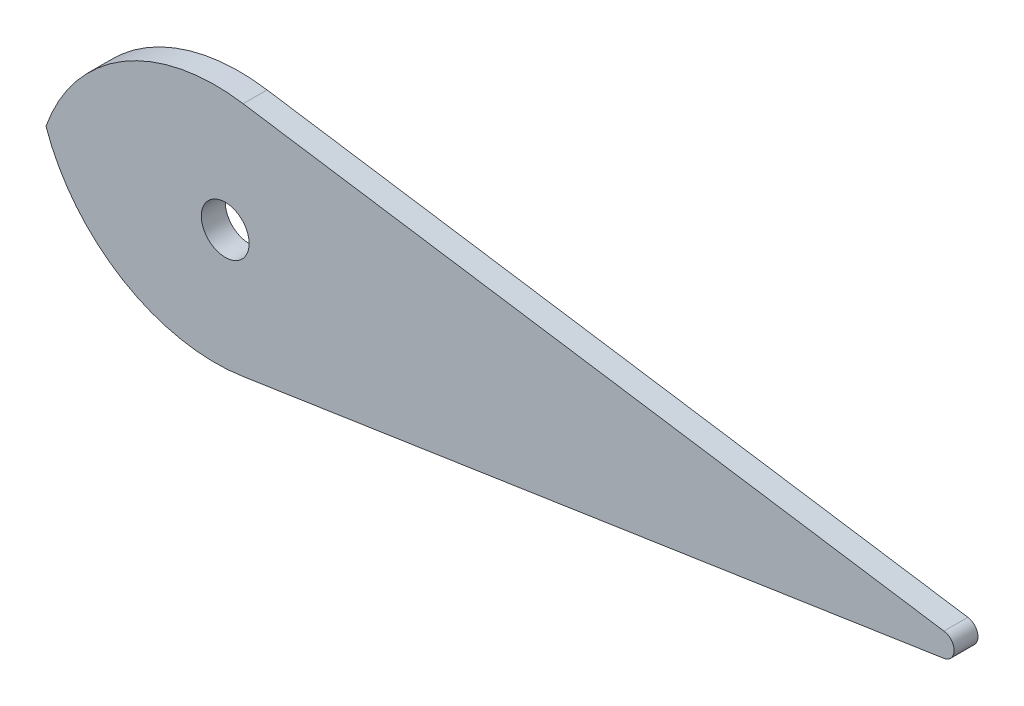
from build123d import *

# Parameters (mm, degrees)
SKETCH1_R          = 0.1
BASE_EXTRUDE_DEPTH = 0.1


with BuildPart() as part:
    # Sketch1 → Base-Extrude (new body)
    with BuildSketch(Plane.XY):
        with BuildLine():
            Line((0.075, 0.494342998), (3.0075, 0.0494343))
            ThreePointArc((3.0075, 0.0494343), (3.05, 0), (3.0075, -0.0494343))
            Line((3.0075, -0.0494343), (0.075, -0.494342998))
            ThreePointArc((0.075, -0.494342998), (-0.427169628, -0.396819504), (-0.75, 0))
            ThreePointArc((-0.75, 0), (-0.427169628, 0.396819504), (0.075, 0.494342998))
        make_face()
        Circle(SKETCH1_R, mode=Mode.SUBTRACT)
    extrude(amount=BASE_EXTRUDE_DEPTH)


solid = part.part
